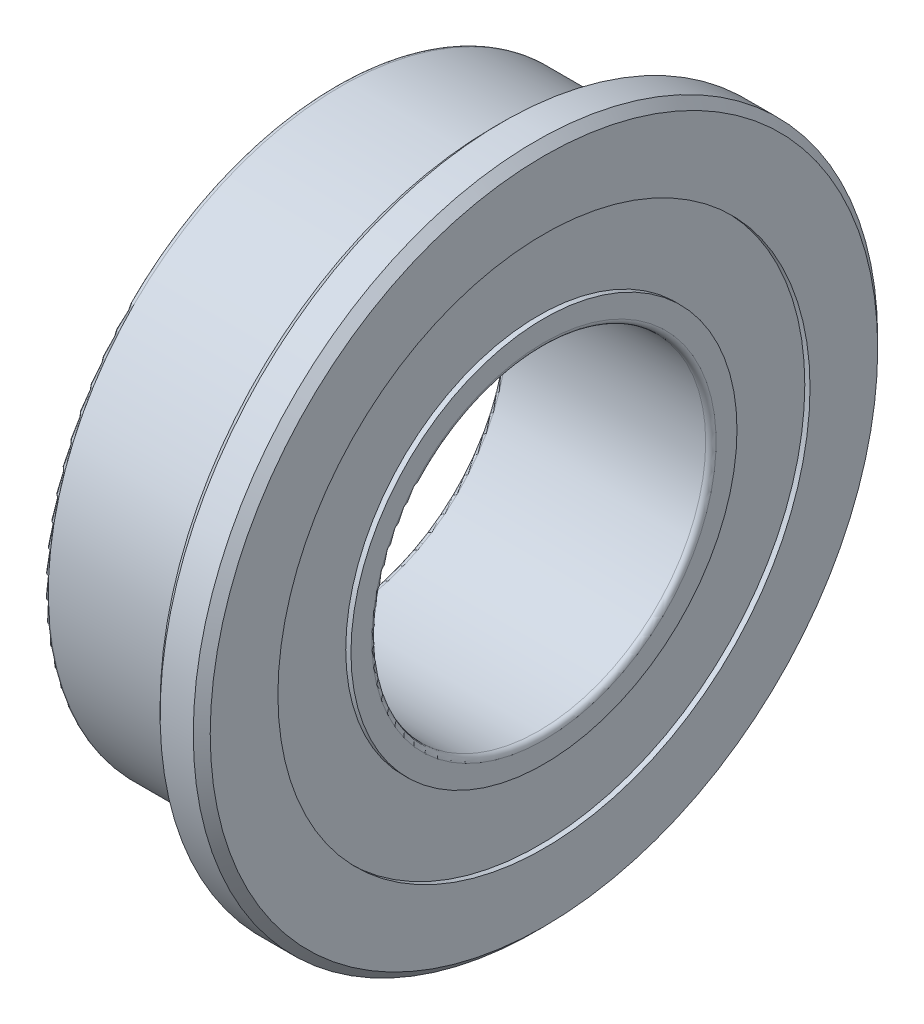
ISO-10303-21;
HEADER;
FILE_DESCRIPTION(('STEP AP214'),'2;1');
FILE_NAME('part.step','',(''),(''),'','','');
FILE_SCHEMA(('AUTOMOTIVE_DESIGN { 1 0 10303 214 1 1 1 1 }'));
ENDSEC;
DATA;
#1=APPLICATION_CONTEXT('core data for automotive mechanical design processes');
#2=APPLICATION_PROTOCOL_DEFINITION('international standard','automotive_design',2000,#1);
#3=PRODUCT_CONTEXT('',#1,'mechanical');
#4=PRODUCT('Part','Part','',(#3));
#5=PRODUCT_RELATED_PRODUCT_CATEGORY('part','',(#4));
#6=PRODUCT_DEFINITION_FORMATION('','',#4);
#7=PRODUCT_DEFINITION_CONTEXT('part definition',#1,'design');
#8=PRODUCT_DEFINITION('design','',#6,#7);
#9=PRODUCT_DEFINITION_SHAPE('','',#8);
#10=(LENGTH_UNIT() NAMED_UNIT(*) SI_UNIT(.MILLI.,.METRE.));
#11=(NAMED_UNIT(*) PLANE_ANGLE_UNIT() SI_UNIT($,.RADIAN.));
#12=(NAMED_UNIT(*) SI_UNIT($,.STERADIAN.) SOLID_ANGLE_UNIT());
#13=UNCERTAINTY_MEASURE_WITH_UNIT(LENGTH_MEASURE(1.E-05),#10,'distance_accuracy_value','');
#14=(GEOMETRIC_REPRESENTATION_CONTEXT(3) GLOBAL_UNCERTAINTY_ASSIGNED_CONTEXT((#13)) GLOBAL_UNIT_ASSIGNED_CONTEXT((#10,
#11,#12)) REPRESENTATION_CONTEXT('',''));
#15=CARTESIAN_POINT('',(0.,0.,0.));
#16=DIRECTION('',(0.,0.,1.));
#17=DIRECTION('',(1.,0.,0.));
#18=AXIS2_PLACEMENT_3D('',#15,#16,#17);
#19=CARTESIAN_POINT('',(0.,-2.75,0.));
#20=DIRECTION('',(0.,1.,0.));
#21=DIRECTION('',(0.,0.,1.));
#22=AXIS2_PLACEMENT_3D('',#19,#20,#21);
#23=SPHERICAL_SURFACE('',#22,0.625);
#24=CARTESIAN_POINT('',(0.,-2.125,0.));
#25=VERTEX_POINT('',#24);
#26=VERTEX_LOOP('',#25);
#27=FACE_BOUND('',#26,.T.);
#28=CARTESIAN_POINT('',(0.,-3.375,0.));
#29=VERTEX_POINT('',#28);
#30=VERTEX_LOOP('',#29);
#31=FACE_BOUND('',#30,.T.);
#32=ADVANCED_FACE('P0_F16',(#27,#31),#23,.T.);
#33=CLOSED_SHELL('',(#32));
#34=MANIFOLD_SOLID_BREP('P0_B1',#33);
#35=CARTESIAN_POINT('',(0.,2.224796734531,1.616409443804));
#36=DIRECTION('',(0.,-0.809016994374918,-0.587785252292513));
#37=DIRECTION('',(0.,0.587785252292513,-0.809016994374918));
#38=AXIS2_PLACEMENT_3D('',#35,#36,#37);
#39=SPHERICAL_SURFACE('',#38,0.625);
#40=CARTESIAN_POINT('',(0.,1.71916111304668,1.24904366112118));
#41=VERTEX_POINT('',#40);
#42=VERTEX_LOOP('',#41);
#43=FACE_BOUND('',#42,.T.);
#44=CARTESIAN_POINT('',(0.,2.73043235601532,1.98377522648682));
#45=VERTEX_POINT('',#44);
#46=VERTEX_LOOP('',#45);
#47=FACE_BOUND('',#46,.T.);
#48=ADVANCED_FACE('P1_F16',(#43,#47),#39,.T.);
#49=CLOSED_SHELL('',(#48));
#50=MANIFOLD_SOLID_BREP('P1_B1',#49);
#51=CARTESIAN_POINT('',(1.25,0.,0.));
#52=DIRECTION('',(1.,0.,0.));
#53=DIRECTION('',(0.,0.,-1.));
#54=AXIS2_PLACEMENT_3D('',#51,#52,#53);
#55=PLANE('',#54);
#56=CARTESIAN_POINT('',(1.25,0.,0.));
#57=DIRECTION('',(1.,0.,0.));
#58=DIRECTION('',(0.,1.,0.));
#59=AXIS2_PLACEMENT_3D('',#56,#57,#58);
#60=CIRCLE('',#59,2.0625);
#61=CARTESIAN_POINT('',(1.25,2.0625,0.));
#62=VERTEX_POINT('',#61);
#63=CARTESIAN_POINT('',(1.25,-2.0625,0.));
#64=VERTEX_POINT('',#63);
#65=EDGE_CURVE('P2_E58',#62,#64,#60,.T.);
#66=ORIENTED_EDGE('',*,*,#65,.F.);
#67=CARTESIAN_POINT('',(1.25,0.,0.));
#68=DIRECTION('',(1.,0.,0.));
#69=DIRECTION('',(0.,-1.,0.));
#70=AXIS2_PLACEMENT_3D('',#67,#68,#69);
#71=CIRCLE('',#70,2.0625);
#72=EDGE_CURVE('P2_E63',#64,#62,#71,.T.);
#73=ORIENTED_EDGE('',*,*,#72,.F.);
#74=EDGE_LOOP('',(#66,#73));
#75=FACE_BOUND('',#74,.T.);
#76=CARTESIAN_POINT('',(1.25,0.,0.));
#77=DIRECTION('',(1.,0.,0.));
#78=DIRECTION('',(0.,0.,-1.));
#79=AXIS2_PLACEMENT_3D('',#76,#77,#78);
#80=CIRCLE('',#79,2.3125);
#81=CARTESIAN_POINT('',(1.25,0.,-2.3125));
#82=VERTEX_POINT('',#81);
#83=EDGE_CURVE('P2_E71',#82,#82,#80,.F.);
#84=ORIENTED_EDGE('',*,*,#83,.F.);
#85=EDGE_LOOP('',(#84));
#86=FACE_BOUND('',#85,.T.);
#87=ADVANCED_FACE('P2_F18',(#75,#86),#55,.T.);
#88=CARTESIAN_POINT('',(1.1875,0.,0.));
#89=DIRECTION('',(1.,0.,0.));
#90=DIRECTION('',(0.,-1.,0.));
#91=AXIS2_PLACEMENT_3D('',#88,#89,#90);
#92=TOROIDAL_SURFACE('',#91,2.0625,0.0625);
#93=ORIENTED_EDGE('',*,*,#65,.T.);
#94=ORIENTED_EDGE('',*,*,#72,.T.);
#95=EDGE_LOOP('',(#93,#94));
#96=FACE_BOUND('',#95,.T.);
#97=CARTESIAN_POINT('',(1.1875,0.,0.));
#98=DIRECTION('',(1.,0.,0.));
#99=DIRECTION('',(0.,0.,-1.));
#100=AXIS2_PLACEMENT_3D('',#97,#98,#99);
#101=CIRCLE('',#100,2.);
#102=CARTESIAN_POINT('',(1.1875,0.,-2.));
#103=VERTEX_POINT('',#102);
#104=EDGE_CURVE('P2_E94',#103,#103,#101,.F.);
#105=ORIENTED_EDGE('',*,*,#104,.T.);
#106=EDGE_LOOP('',(#105));
#107=FACE_BOUND('',#106,.T.);
#108=ADVANCED_FACE('P2_F69',(#96,#107),#92,.T.);
#109=CARTESIAN_POINT('',(-1.375,0.,0.));
#110=DIRECTION('',(1.,0.,0.));
#111=DIRECTION('',(0.,0.,-1.));
#112=AXIS2_PLACEMENT_3D('',#109,#110,#111);
#113=CYLINDRICAL_SURFACE('',#112,2.3125);
#114=ORIENTED_EDGE('',*,*,#83,.T.);
#115=EDGE_LOOP('',(#114));
#116=FACE_BOUND('',#115,.T.);
#117=CARTESIAN_POINT('',(1.1875,0.,0.));
#118=DIRECTION('',(1.,0.,0.));
#119=DIRECTION('',(0.,0.,-1.));
#120=AXIS2_PLACEMENT_3D('',#117,#118,#119);
#121=CIRCLE('',#120,2.3125);
#122=CARTESIAN_POINT('',(1.1875,0.,-2.3125));
#123=VERTEX_POINT('',#122);
#124=EDGE_CURVE('P2_E97',#123,#123,#121,.F.);
#125=ORIENTED_EDGE('',*,*,#124,.F.);
#126=EDGE_LOOP('',(#125));
#127=FACE_BOUND('',#126,.T.);
#128=ADVANCED_FACE('P2_F89',(#116,#127),#113,.T.);
#129=CARTESIAN_POINT('',(-1.375,0.,0.));
#130=DIRECTION('',(1.,0.,0.));
#131=DIRECTION('',(0.,0.,-1.));
#132=AXIS2_PLACEMENT_3D('',#129,#130,#131);
#133=CYLINDRICAL_SURFACE('',#132,2.);
#134=ORIENTED_EDGE('',*,*,#104,.F.);
#135=EDGE_LOOP('',(#134));
#136=FACE_BOUND('',#135,.T.);
#137=CARTESIAN_POINT('',(-1.1875,0.,0.));
#138=DIRECTION('',(1.,0.,0.));
#139=DIRECTION('',(0.,-1.,0.));
#140=AXIS2_PLACEMENT_3D('',#137,#138,#139);
#141=CIRCLE('',#140,2.);
#142=CARTESIAN_POINT('',(-1.1875,-2.,0.));
#143=VERTEX_POINT('',#142);
#144=EDGE_CURVE('P2_E98',#143,#143,#141,.T.);
#145=ORIENTED_EDGE('',*,*,#144,.F.);
#146=EDGE_LOOP('',(#145));
#147=FACE_BOUND('',#146,.T.);
#148=ADVANCED_FACE('P2_F561',(#136,#147),#133,.F.);
#149=CARTESIAN_POINT('',(1.1875,0.,0.));
#150=DIRECTION('',(1.,0.,0.));
#151=DIRECTION('',(0.,0.,-1.));
#152=AXIS2_PLACEMENT_3D('',#149,#150,#151);
#153=PLANE('',#152);
#154=ORIENTED_EDGE('',*,*,#124,.T.);
#155=EDGE_LOOP('',(#154));
#156=FACE_BOUND('',#155,.T.);
#157=CARTESIAN_POINT('',(1.1875,0.,0.));
#158=DIRECTION('',(1.,0.,0.));
#159=DIRECTION('',(0.,0.,-1.));
#160=AXIS2_PLACEMENT_3D('',#157,#158,#159);
#161=CIRCLE('',#160,3.1875);
#162=CARTESIAN_POINT('',(1.1875,0.,-3.1875));
#163=VERTEX_POINT('',#162);
#164=EDGE_CURVE('P2_E101',#163,#163,#161,.T.);
#165=ORIENTED_EDGE('',*,*,#164,.T.);
#166=EDGE_LOOP('',(#165));
#167=FACE_BOUND('',#166,.T.);
#168=ADVANCED_FACE('P2_F118',(#156,#167),#153,.T.);
#169=CARTESIAN_POINT('',(-1.1875,0.,0.));
#170=DIRECTION('',(1.,0.,0.));
#171=DIRECTION('',(0.,-1.,0.));
#172=AXIS2_PLACEMENT_3D('',#169,#170,#171);
#173=TOROIDAL_SURFACE('',#172,2.0625,0.0625);
#174=ORIENTED_EDGE('',*,*,#144,.T.);
#175=EDGE_LOOP('',(#174));
#176=FACE_BOUND('',#175,.T.);
#177=CARTESIAN_POINT('',(-1.25,0.,0.));
#178=DIRECTION('',(-1.,0.,0.));
#179=DIRECTION('',(0.,1.,0.));
#180=AXIS2_PLACEMENT_3D('',#177,#178,#179);
#181=CIRCLE('',#180,2.0625);
#182=CARTESIAN_POINT('',(-1.25,2.0625,0.));
#183=VERTEX_POINT('',#182);
#184=CARTESIAN_POINT('',(-1.25,-2.0625,0.));
#185=VERTEX_POINT('',#184);
#186=EDGE_CURVE('P2_E337',#183,#185,#181,.T.);
#187=ORIENTED_EDGE('',*,*,#186,.T.);
#188=CARTESIAN_POINT('',(-1.25,0.,0.));
#189=DIRECTION('',(-1.,0.,0.));
#190=DIRECTION('',(0.,-1.,0.));
#191=AXIS2_PLACEMENT_3D('',#188,#189,#190);
#192=CIRCLE('',#191,2.0625);
#193=EDGE_CURVE('P2_E152',#185,#183,#192,.T.);
#194=ORIENTED_EDGE('',*,*,#193,.T.);
#195=EDGE_LOOP('',(#187,#194));
#196=FACE_BOUND('',#195,.T.);
#197=ADVANCED_FACE('P2_F107',(#176,#196),#173,.T.);
#198=CARTESIAN_POINT('',(-1.375,0.,0.));
#199=DIRECTION('',(1.,0.,0.));
#200=DIRECTION('',(0.,0.,-1.));
#201=AXIS2_PLACEMENT_3D('',#198,#199,#200);
#202=CYLINDRICAL_SURFACE('',#201,3.1875);
#203=CARTESIAN_POINT('',(1.25,0.,0.));
#204=DIRECTION('',(1.,0.,0.));
#205=DIRECTION('',(0.,0.,-1.));
#206=AXIS2_PLACEMENT_3D('',#203,#204,#205);
#207=CIRCLE('',#206,3.1875);
#208=CARTESIAN_POINT('',(1.25,0.,-3.1875));
#209=VERTEX_POINT('',#208);
#210=EDGE_CURVE('P2_E334',#209,#209,#207,.F.);
#211=ORIENTED_EDGE('',*,*,#210,.F.);
#212=EDGE_LOOP('',(#211));
#213=FACE_BOUND('',#212,.T.);
#214=ORIENTED_EDGE('',*,*,#164,.F.);
#215=EDGE_LOOP('',(#214));
#216=FACE_BOUND('',#215,.T.);
#217=ADVANCED_FACE('P2_F117',(#213,#216),#202,.F.);
#218=CARTESIAN_POINT('',(-1.25,0.,0.));
#219=DIRECTION('',(1.,0.,0.));
#220=DIRECTION('',(0.,0.,-1.));
#221=AXIS2_PLACEMENT_3D('',#218,#219,#220);
#222=PLANE('',#221);
#223=ORIENTED_EDGE('',*,*,#193,.F.);
#224=ORIENTED_EDGE('',*,*,#186,.F.);
#225=EDGE_LOOP('',(#223,#224));
#226=FACE_BOUND('',#225,.T.);
#227=CARTESIAN_POINT('',(-1.25,0.,0.));
#228=DIRECTION('',(1.,0.,0.));
#229=DIRECTION('',(0.,0.,-1.));
#230=AXIS2_PLACEMENT_3D('',#227,#228,#229);
#231=CIRCLE('',#230,2.3125);
#232=CARTESIAN_POINT('',(-1.25,0.,-2.3125));
#233=VERTEX_POINT('',#232);
#234=EDGE_CURVE('P2_E332',#233,#233,#231,.T.);
#235=ORIENTED_EDGE('',*,*,#234,.F.);
#236=EDGE_LOOP('',(#235));
#237=FACE_BOUND('',#236,.T.);
#238=ADVANCED_FACE('P2_F129',(#226,#237),#222,.F.);
#239=CARTESIAN_POINT('',(1.25,0.,0.));
#240=DIRECTION('',(1.,0.,0.));
#241=DIRECTION('',(0.,0.,-1.));
#242=AXIS2_PLACEMENT_3D('',#239,#240,#241);
#243=PLANE('',#242);
#244=ORIENTED_EDGE('',*,*,#210,.T.);
#245=EDGE_LOOP('',(#244));
#246=FACE_BOUND('',#245,.T.);
#247=CARTESIAN_POINT('',(1.25000000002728,0.,0.));
#248=DIRECTION('',(-1.,0.,0.));
#249=DIRECTION('',(0.,0.,1.));
#250=AXIS2_PLACEMENT_3D('',#247,#248,#249);
#251=CIRCLE('',#250,3.9984000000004);
#252=CARTESIAN_POINT('',(1.25000000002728,0.,3.9984000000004));
#253=VERTEX_POINT('',#252);
#254=EDGE_CURVE('P2_E329',#253,#253,#251,.T.);
#255=ORIENTED_EDGE('',*,*,#254,.F.);
#256=EDGE_LOOP('',(#255));
#257=FACE_BOUND('',#256,.T.);
#258=ADVANCED_FACE('P2_F138',(#246,#257),#243,.T.);
#259=CARTESIAN_POINT('',(-1.375,0.,0.));
#260=DIRECTION('',(1.,0.,0.));
#261=DIRECTION('',(0.,0.,-1.));
#262=AXIS2_PLACEMENT_3D('',#259,#260,#261);
#263=CYLINDRICAL_SURFACE('',#262,2.3125);
#264=ORIENTED_EDGE('',*,*,#234,.T.);
#265=EDGE_LOOP('',(#264));
#266=FACE_BOUND('',#265,.T.);
#267=CARTESIAN_POINT('',(-1.1875,0.,0.));
#268=DIRECTION('',(1.,0.,0.));
#269=DIRECTION('',(0.,0.,-1.));
#270=AXIS2_PLACEMENT_3D('',#267,#268,#269);
#271=CIRCLE('',#270,2.3125);
#272=CARTESIAN_POINT('',(-1.1875,0.,-2.3125));
#273=VERTEX_POINT('',#272);
#274=EDGE_CURVE('P2_E157',#273,#273,#271,.F.);
#275=ORIENTED_EDGE('',*,*,#274,.T.);
#276=EDGE_LOOP('',(#275));
#277=FACE_BOUND('',#276,.T.);
#278=ADVANCED_FACE('P2_F264',(#266,#277),#263,.T.);
#279=CARTESIAN_POINT('',(1.14840000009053,0.,0.));
#280=DIRECTION('',(-1.,0.,0.));
#281=DIRECTION('',(0.,0.,1.));
#282=AXIS2_PLACEMENT_3D('',#279,#280,#281);
#283=CONICAL_SURFACE('',#282,4.09999999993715,0.785398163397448);
#284=ORIENTED_EDGE('',*,*,#254,.T.);
#285=EDGE_LOOP('',(#284));
#286=FACE_BOUND('',#285,.T.);
#287=CARTESIAN_POINT('',(1.1484,0.,0.));
#288=DIRECTION('',(1.,0.,0.));
#289=DIRECTION('',(0.,0.,-1.));
#290=AXIS2_PLACEMENT_3D('',#287,#288,#289);
#291=CIRCLE('',#290,4.1);
#292=CARTESIAN_POINT('',(1.1484,0.,-4.1));
#293=VERTEX_POINT('',#292);
#294=EDGE_CURVE('P2_E153',#293,#293,#291,.F.);
#295=ORIENTED_EDGE('',*,*,#294,.F.);
#296=EDGE_LOOP('',(#295));
#297=FACE_BOUND('',#296,.T.);
#298=ADVANCED_FACE('P2_F261',(#286,#297),#283,.T.);
#299=CARTESIAN_POINT('',(-1.1875,0.,0.));
#300=DIRECTION('',(1.,0.,0.));
#301=DIRECTION('',(0.,0.,-1.));
#302=AXIS2_PLACEMENT_3D('',#299,#300,#301);
#303=PLANE('',#302);
#304=ORIENTED_EDGE('',*,*,#274,.F.);
#305=EDGE_LOOP('',(#304));
#306=FACE_BOUND('',#305,.T.);
#307=CARTESIAN_POINT('',(-1.1875,0.,0.));
#308=DIRECTION('',(1.,0.,0.));
#309=DIRECTION('',(0.,0.,-1.));
#310=AXIS2_PLACEMENT_3D('',#307,#308,#309);
#311=CIRCLE('',#310,3.1875);
#312=CARTESIAN_POINT('',(-1.1875,0.,-3.1875));
#313=VERTEX_POINT('',#312);
#314=EDGE_CURVE('P2_E156',#313,#313,#311,.F.);
#315=ORIENTED_EDGE('',*,*,#314,.T.);
#316=EDGE_LOOP('',(#315));
#317=FACE_BOUND('',#316,.T.);
#318=ADVANCED_FACE('P2_F257',(#306,#317),#303,.F.);
#319=CARTESIAN_POINT('',(0.515,0.,0.));
#320=DIRECTION('',(1.,0.,0.));
#321=DIRECTION('',(0.,0.,-1.));
#322=AXIS2_PLACEMENT_3D('',#319,#320,#321);
#323=CYLINDRICAL_SURFACE('',#322,4.1);
#324=ORIENTED_EDGE('',*,*,#294,.T.);
#325=EDGE_LOOP('',(#324));
#326=FACE_BOUND('',#325,.T.);
#327=CARTESIAN_POINT('',(0.75159999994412,0.,0.));
#328=DIRECTION('',(1.,0.,0.));
#329=DIRECTION('',(0.,-1.,0.));
#330=AXIS2_PLACEMENT_3D('',#327,#328,#329);
#331=CIRCLE('',#330,4.099999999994);
#332=CARTESIAN_POINT('',(0.751599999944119,-4.099999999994,0.));
#333=VERTEX_POINT('',#332);
#334=EDGE_CURVE('P2_E158',#333,#333,#331,.F.);
#335=ORIENTED_EDGE('',*,*,#334,.F.);
#336=EDGE_LOOP('',(#335));
#337=FACE_BOUND('',#336,.T.);
#338=ADVANCED_FACE('P2_F253',(#326,#337),#323,.T.);
#339=CARTESIAN_POINT('',(-1.375,0.,0.));
#340=DIRECTION('',(1.,0.,0.));
#341=DIRECTION('',(0.,0.,-1.));
#342=AXIS2_PLACEMENT_3D('',#339,#340,#341);
#343=CYLINDRICAL_SURFACE('',#342,3.1875);
#344=CARTESIAN_POINT('',(-1.25,0.,0.));
#345=DIRECTION('',(1.,0.,0.));
#346=DIRECTION('',(0.,0.,-1.));
#347=AXIS2_PLACEMENT_3D('',#344,#345,#346);
#348=CIRCLE('',#347,3.1875);
#349=CARTESIAN_POINT('',(-1.25,0.,-3.1875));
#350=VERTEX_POINT('',#349);
#351=EDGE_CURVE('P2_E160',#350,#350,#348,.F.);
#352=ORIENTED_EDGE('',*,*,#351,.T.);
#353=EDGE_LOOP('',(#352));
#354=FACE_BOUND('',#353,.T.);
#355=ORIENTED_EDGE('',*,*,#314,.F.);
#356=EDGE_LOOP('',(#355));
#357=FACE_BOUND('',#356,.T.);
#358=ADVANCED_FACE('P2_F249',(#354,#357),#343,.F.);
#359=CARTESIAN_POINT('',(0.751599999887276,0.,0.));
#360=DIRECTION('',(1.,0.,0.));
#361=DIRECTION('',(0.,0.,-1.));
#362=AXIS2_PLACEMENT_3D('',#359,#360,#361);
#363=CONICAL_SURFACE('',#362,4.09999999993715,0.785398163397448);
#364=ORIENTED_EDGE('',*,*,#334,.T.);
#365=EDGE_LOOP('',(#364));
#366=FACE_BOUND('',#365,.T.);
#367=CARTESIAN_POINT('',(0.649999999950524,0.,0.));
#368=DIRECTION('',(1.,0.,0.));
#369=DIRECTION('',(0.,0.,-1.));
#370=AXIS2_PLACEMENT_3D('',#367,#368,#369);
#371=CIRCLE('',#370,3.9984000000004);
#372=CARTESIAN_POINT('',(0.649999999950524,0.,-3.9984000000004));
#373=VERTEX_POINT('',#372);
#374=EDGE_CURVE('P2_E79',#373,#373,#371,.T.);
#375=ORIENTED_EDGE('',*,*,#374,.T.);
#376=EDGE_LOOP('',(#375));
#377=FACE_BOUND('',#376,.T.);
#378=ADVANCED_FACE('P2_F237',(#366,#377),#363,.T.);
#379=CARTESIAN_POINT('',(-1.25,0.,0.));
#380=DIRECTION('',(1.,0.,0.));
#381=DIRECTION('',(0.,0.,-1.));
#382=AXIS2_PLACEMENT_3D('',#379,#380,#381);
#383=PLANE('',#382);
#384=ORIENTED_EDGE('',*,*,#351,.F.);
#385=EDGE_LOOP('',(#384));
#386=FACE_BOUND('',#385,.T.);
#387=CARTESIAN_POINT('',(-1.25,0.,0.));
#388=DIRECTION('',(1.,0.,0.));
#389=DIRECTION('',(0.,-1.,0.));
#390=AXIS2_PLACEMENT_3D('',#387,#388,#389);
#391=CIRCLE('',#390,3.4375);
#392=CARTESIAN_POINT('',(-1.25,-3.4375,0.));
#393=VERTEX_POINT('',#392);
#394=CARTESIAN_POINT('',(-1.25,3.4375,0.));
#395=VERTEX_POINT('',#394);
#396=EDGE_CURVE('P2_E224',#393,#395,#391,.T.);
#397=ORIENTED_EDGE('',*,*,#396,.F.);
#398=CARTESIAN_POINT('',(-1.25,0.,0.));
#399=DIRECTION('',(1.,0.,0.));
#400=DIRECTION('',(0.,1.,0.));
#401=AXIS2_PLACEMENT_3D('',#398,#399,#400);
#402=CIRCLE('',#401,3.4375);
#403=EDGE_CURVE('P2_E316',#395,#393,#402,.T.);
#404=ORIENTED_EDGE('',*,*,#403,.F.);
#405=EDGE_LOOP('',(#397,#404));
#406=FACE_BOUND('',#405,.T.);
#407=ADVANCED_FACE('P2_F228',(#386,#406),#383,.F.);
#408=CARTESIAN_POINT('',(0.65,0.,0.));
#409=DIRECTION('',(1.,0.,0.));
#410=DIRECTION('',(0.,0.,-1.));
#411=AXIS2_PLACEMENT_3D('',#408,#409,#410);
#412=PLANE('',#411);
#413=CARTESIAN_POINT('',(0.65,0.,0.));
#414=DIRECTION('',(-1.,0.,0.));
#415=DIRECTION('',(0.,-1.,0.));
#416=AXIS2_PLACEMENT_3D('',#413,#414,#415);
#417=CIRCLE('',#416,3.6);
#418=CARTESIAN_POINT('',(0.65,3.6,0.));
#419=VERTEX_POINT('',#418);
#420=CARTESIAN_POINT('',(0.65,-3.6,0.));
#421=VERTEX_POINT('',#420);
#422=EDGE_CURVE('P2_E194',#419,#421,#417,.F.);
#423=ORIENTED_EDGE('',*,*,#422,.T.);
#424=CARTESIAN_POINT('',(0.65,0.,0.));
#425=DIRECTION('',(-1.,0.,0.));
#426=DIRECTION('',(0.,1.,0.));
#427=AXIS2_PLACEMENT_3D('',#424,#425,#426);
#428=CIRCLE('',#427,3.6);
#429=EDGE_CURVE('P2_E37',#419,#421,#428,.T.);
#430=ORIENTED_EDGE('',*,*,#429,.F.);
#431=EDGE_LOOP('',(#423,#430));
#432=FACE_BOUND('',#431,.T.);
#433=ORIENTED_EDGE('',*,*,#374,.F.);
#434=EDGE_LOOP('',(#433));
#435=FACE_BOUND('',#434,.T.);
#436=ADVANCED_FACE('P2_F180',(#432,#435),#412,.F.);
#437=CARTESIAN_POINT('',(-1.1875,0.,0.));
#438=DIRECTION('',(1.,0.,0.));
#439=DIRECTION('',(0.,-1.,0.));
#440=AXIS2_PLACEMENT_3D('',#437,#438,#439);
#441=TOROIDAL_SURFACE('',#440,3.4375,0.0625);
#442=CARTESIAN_POINT('',(-1.1875,0.,0.));
#443=DIRECTION('',(1.,0.,0.));
#444=DIRECTION('',(0.,0.,-1.));
#445=AXIS2_PLACEMENT_3D('',#442,#443,#444);
#446=CIRCLE('',#445,3.5);
#447=CARTESIAN_POINT('',(-1.1875,0.,-3.5));
#448=VERTEX_POINT('',#447);
#449=EDGE_CURVE('P2_E29',#448,#448,#446,.T.);
#450=ORIENTED_EDGE('',*,*,#449,.F.);
#451=EDGE_LOOP('',(#450));
#452=FACE_BOUND('',#451,.T.);
#453=ORIENTED_EDGE('',*,*,#403,.T.);
#454=ORIENTED_EDGE('',*,*,#396,.T.);
#455=EDGE_LOOP('',(#453,#454));
#456=FACE_BOUND('',#455,.T.);
#457=ADVANCED_FACE('P2_F168',(#452,#456),#441,.T.);
#458=CARTESIAN_POINT('',(0.55,0.,0.));
#459=DIRECTION('',(1.,0.,0.));
#460=DIRECTION('',(0.,-1.,0.));
#461=AXIS2_PLACEMENT_3D('',#458,#459,#460);
#462=TOROIDAL_SURFACE('',#461,3.6,0.1);
#463=ORIENTED_EDGE('',*,*,#429,.T.);
#464=ORIENTED_EDGE('',*,*,#422,.F.);
#465=EDGE_LOOP('',(#463,#464));
#466=FACE_BOUND('',#465,.T.);
#467=CARTESIAN_POINT('',(0.55,0.,0.));
#468=DIRECTION('',(1.,0.,0.));
#469=DIRECTION('',(0.,0.,-1.));
#470=AXIS2_PLACEMENT_3D('',#467,#468,#469);
#471=CIRCLE('',#470,3.5);
#472=CARTESIAN_POINT('',(0.55,0.,-3.5));
#473=VERTEX_POINT('',#472);
#474=EDGE_CURVE('P2_E11',#473,#473,#471,.F.);
#475=ORIENTED_EDGE('',*,*,#474,.F.);
#476=EDGE_LOOP('',(#475));
#477=FACE_BOUND('',#476,.T.);
#478=ADVANCED_FACE('P2_F179',(#466,#477),#462,.F.);
#479=CARTESIAN_POINT('',(-1.375,0.,0.));
#480=DIRECTION('',(1.,0.,0.));
#481=DIRECTION('',(0.,0.,-1.));
#482=AXIS2_PLACEMENT_3D('',#479,#480,#481);
#483=CYLINDRICAL_SURFACE('',#482,3.5);
#484=ORIENTED_EDGE('',*,*,#449,.T.);
#485=EDGE_LOOP('',(#484));
#486=FACE_BOUND('',#485,.T.);
#487=ORIENTED_EDGE('',*,*,#474,.T.);
#488=EDGE_LOOP('',(#487));
#489=FACE_BOUND('',#488,.T.);
#490=ADVANCED_FACE('P2_F275',(#486,#489),#483,.T.);
#491=CLOSED_SHELL('',(#87,#108,#128,#148,#168,#197,#217,#238,#258,#278,#298,#318,#338,#358,#378,
#407,#436,#457,#478,#490));
#492=CARTESIAN_POINT('',(-0.9335,0.,0.));
#493=DIRECTION('',(1.,0.,0.));
#494=DIRECTION('',(0.,0.,-1.));
#495=AXIS2_PLACEMENT_3D('',#492,#493,#494);
#496=PLANE('',#495);
#497=CARTESIAN_POINT('',(-0.9335,0.,0.));
#498=DIRECTION('',(1.,0.,0.));
#499=DIRECTION('',(0.,0.,-1.));
#500=AXIS2_PLACEMENT_3D('',#497,#498,#499);
#501=CIRCLE('',#500,2.3125);
#502=CARTESIAN_POINT('',(-0.9335,0.,-2.3125));
#503=VERTEX_POINT('',#502);
#504=EDGE_CURVE('P2_E314',#503,#503,#501,.T.);
#505=ORIENTED_EDGE('',*,*,#504,.F.);
#506=EDGE_LOOP('',(#505));
#507=FACE_BOUND('',#506,.T.);
#508=CARTESIAN_POINT('',(-0.9335,0.,0.));
#509=DIRECTION('',(1.,0.,0.));
#510=DIRECTION('',(0.,0.,-1.));
#511=AXIS2_PLACEMENT_3D('',#508,#509,#510);
#512=CIRCLE('',#511,3.1875);
#513=CARTESIAN_POINT('',(-0.9335,0.,-3.1875));
#514=VERTEX_POINT('',#513);
#515=EDGE_CURVE('P2_E352',#514,#514,#512,.T.);
#516=ORIENTED_EDGE('',*,*,#515,.T.);
#517=EDGE_LOOP('',(#516));
#518=FACE_BOUND('',#517,.T.);
#519=ADVANCED_FACE('P2_F285',(#507,#518),#496,.T.);
#520=CARTESIAN_POINT('',(-1.375,0.,0.));
#521=DIRECTION('',(1.,0.,0.));
#522=DIRECTION('',(0.,0.,-1.));
#523=AXIS2_PLACEMENT_3D('',#520,#521,#522);
#524=CYLINDRICAL_SURFACE('',#523,3.1875);
#525=CARTESIAN_POINT('',(-0.446339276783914,0.,0.));
#526=DIRECTION('',(1.,0.,0.));
#527=DIRECTION('',(0.,-1.,0.));
#528=AXIS2_PLACEMENT_3D('',#525,#526,#527);
#529=CIRCLE('',#528,3.18750000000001);
#530=CARTESIAN_POINT('',(-0.446339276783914,-3.18750000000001,0.));
#531=VERTEX_POINT('',#530);
#532=EDGE_CURVE('P2_E312',#531,#531,#529,.T.);
#533=ORIENTED_EDGE('',*,*,#532,.T.);
#534=EDGE_LOOP('',(#533));
#535=FACE_BOUND('',#534,.T.);
#536=ORIENTED_EDGE('',*,*,#515,.F.);
#537=EDGE_LOOP('',(#536));
#538=FACE_BOUND('',#537,.T.);
#539=ADVANCED_FACE('P2_F287',(#535,#538),#524,.F.);
#540=CARTESIAN_POINT('',(-1.375,0.,0.));
#541=DIRECTION('',(1.,0.,0.));
#542=DIRECTION('',(0.,0.,-1.));
#543=AXIS2_PLACEMENT_3D('',#540,#541,#542);
#544=CYLINDRICAL_SURFACE('',#543,2.3125);
#545=CARTESIAN_POINT('',(-0.446339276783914,0.,0.));
#546=DIRECTION('',(1.,0.,0.));
#547=DIRECTION('',(0.,-1.,0.));
#548=AXIS2_PLACEMENT_3D('',#545,#546,#547);
#549=CIRCLE('',#548,2.31249999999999);
#550=CARTESIAN_POINT('',(-0.446339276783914,-2.31249999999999,0.));
#551=VERTEX_POINT('',#550);
#552=EDGE_CURVE('P2_E309',#551,#551,#549,.F.);
#553=ORIENTED_EDGE('',*,*,#552,.T.);
#554=EDGE_LOOP('',(#553));
#555=FACE_BOUND('',#554,.T.);
#556=ORIENTED_EDGE('',*,*,#504,.T.);
#557=EDGE_LOOP('',(#556));
#558=FACE_BOUND('',#557,.T.);
#559=ADVANCED_FACE('P2_F292',(#555,#558),#544,.T.);
#560=CARTESIAN_POINT('',(0.,0.,0.));
#561=DIRECTION('',(1.,0.,0.));
#562=DIRECTION('',(0.,-1.,0.));
#563=AXIS2_PLACEMENT_3D('',#560,#561,#562);
#564=TOROIDAL_SURFACE('',#563,2.75,0.625);
#565=CARTESIAN_POINT('',(0.4463392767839,0.,0.));
#566=DIRECTION('',(1.,0.,0.));
#567=DIRECTION('',(0.,0.,-1.));
#568=AXIS2_PLACEMENT_3D('',#565,#566,#567);
#569=CIRCLE('',#568,3.1875);
#570=CARTESIAN_POINT('',(0.4463392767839,0.,-3.1875));
#571=VERTEX_POINT('',#570);
#572=EDGE_CURVE('P2_E308',#571,#571,#569,.T.);
#573=ORIENTED_EDGE('',*,*,#572,.T.);
#574=EDGE_LOOP('',(#573));
#575=FACE_BOUND('',#574,.T.);
#576=ORIENTED_EDGE('',*,*,#532,.F.);
#577=EDGE_LOOP('',(#576));
#578=FACE_BOUND('',#577,.T.);
#579=ADVANCED_FACE('P2_F296',(#575,#578),#564,.F.);
#580=CARTESIAN_POINT('',(0.,0.,0.));
#581=DIRECTION('',(1.,0.,0.));
#582=DIRECTION('',(0.,-1.,0.));
#583=AXIS2_PLACEMENT_3D('',#580,#581,#582);
#584=TOROIDAL_SURFACE('',#583,2.75,0.625);
#585=ORIENTED_EDGE('',*,*,#552,.F.);
#586=EDGE_LOOP('',(#585));
#587=FACE_BOUND('',#586,.T.);
#588=CARTESIAN_POINT('',(0.4463392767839,0.,0.));
#589=DIRECTION('',(1.,0.,0.));
#590=DIRECTION('',(0.,0.,-1.));
#591=AXIS2_PLACEMENT_3D('',#588,#589,#590);
#592=CIRCLE('',#591,2.3125);
#593=CARTESIAN_POINT('',(0.4463392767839,0.,-2.3125));
#594=VERTEX_POINT('',#593);
#595=EDGE_CURVE('P2_E349',#594,#594,#592,.T.);
#596=ORIENTED_EDGE('',*,*,#595,.F.);
#597=EDGE_LOOP('',(#596));
#598=FACE_BOUND('',#597,.T.);
#599=ADVANCED_FACE('P2_F301',(#587,#598),#584,.F.);
#600=CARTESIAN_POINT('',(-1.375,0.,0.));
#601=DIRECTION('',(1.,0.,0.));
#602=DIRECTION('',(0.,0.,-1.));
#603=AXIS2_PLACEMENT_3D('',#600,#601,#602);
#604=CYLINDRICAL_SURFACE('',#603,3.1875);
#605=ORIENTED_EDGE('',*,*,#572,.F.);
#606=EDGE_LOOP('',(#605));
#607=FACE_BOUND('',#606,.T.);
#608=CARTESIAN_POINT('',(0.9335,0.,0.));
#609=DIRECTION('',(1.,0.,0.));
#610=DIRECTION('',(0.,0.,-1.));
#611=AXIS2_PLACEMENT_3D('',#608,#609,#610);
#612=CIRCLE('',#611,3.1875);
#613=CARTESIAN_POINT('',(0.9335,0.,-3.1875));
#614=VERTEX_POINT('',#613);
#615=EDGE_CURVE('P2_E346',#614,#614,#612,.T.);
#616=ORIENTED_EDGE('',*,*,#615,.T.);
#617=EDGE_LOOP('',(#616));
#618=FACE_BOUND('',#617,.T.);
#619=ADVANCED_FACE('P2_F398',(#607,#618),#604,.F.);
#620=CARTESIAN_POINT('',(-1.375,0.,0.));
#621=DIRECTION('',(1.,0.,0.));
#622=DIRECTION('',(0.,0.,-1.));
#623=AXIS2_PLACEMENT_3D('',#620,#621,#622);
#624=CYLINDRICAL_SURFACE('',#623,2.3125);
#625=ORIENTED_EDGE('',*,*,#595,.T.);
#626=EDGE_LOOP('',(#625));
#627=FACE_BOUND('',#626,.T.);
#628=CARTESIAN_POINT('',(0.9335,0.,0.));
#629=DIRECTION('',(1.,0.,0.));
#630=DIRECTION('',(0.,0.,-1.));
#631=AXIS2_PLACEMENT_3D('',#628,#629,#630);
#632=CIRCLE('',#631,2.3125);
#633=CARTESIAN_POINT('',(0.9335,0.,-2.3125));
#634=VERTEX_POINT('',#633);
#635=EDGE_CURVE('P2_E65',#634,#634,#632,.F.);
#636=ORIENTED_EDGE('',*,*,#635,.T.);
#637=EDGE_LOOP('',(#636));
#638=FACE_BOUND('',#637,.T.);
#639=ADVANCED_FACE('P2_F400',(#627,#638),#624,.T.);
#640=CARTESIAN_POINT('',(0.9335,0.,0.));
#641=DIRECTION('',(1.,0.,0.));
#642=DIRECTION('',(0.,0.,-1.));
#643=AXIS2_PLACEMENT_3D('',#640,#641,#642);
#644=PLANE('',#643);
#645=ORIENTED_EDGE('',*,*,#635,.F.);
#646=EDGE_LOOP('',(#645));
#647=FACE_BOUND('',#646,.T.);
#648=ORIENTED_EDGE('',*,*,#615,.F.);
#649=EDGE_LOOP('',(#648));
#650=FACE_BOUND('',#649,.T.);
#651=ADVANCED_FACE('P2_F405',(#647,#650),#644,.F.);
#652=CLOSED_SHELL('',(#519,#539,#559,#579,#599,#619,#639,#651));
#653=ORIENTED_CLOSED_SHELL('',*,#652,.T.);
#654=BREP_WITH_VOIDS('P2_B1',#491,(#653));
#655=CARTESIAN_POINT('',(0.,2.224796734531,-1.616409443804));
#656=DIRECTION('',(0.,-0.809016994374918,0.587785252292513));
#657=DIRECTION('',(0.,-0.587785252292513,-0.809016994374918));
#658=AXIS2_PLACEMENT_3D('',#655,#656,#657);
#659=SPHERICAL_SURFACE('',#658,0.625);
#660=CARTESIAN_POINT('',(0.,1.71916111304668,-1.24904366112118));
#661=VERTEX_POINT('',#660);
#662=VERTEX_LOOP('',#661);
#663=FACE_BOUND('',#662,.T.);
#664=CARTESIAN_POINT('',(0.,2.73043235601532,-1.98377522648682));
#665=VERTEX_POINT('',#664);
#666=VERTEX_LOOP('',#665);
#667=FACE_BOUND('',#666,.T.);
#668=ADVANCED_FACE('P3_F16',(#663,#667),#659,.T.);
#669=CLOSED_SHELL('',(#668));
#670=MANIFOLD_SOLID_BREP('P3_B1',#669);
#671=CARTESIAN_POINT('',(0.,-2.224796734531,-1.616409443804));
#672=DIRECTION('',(0.,0.809016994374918,0.587785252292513));
#673=DIRECTION('',(0.,-0.587785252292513,0.809016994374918));
#674=AXIS2_PLACEMENT_3D('',#671,#672,#673);
#675=SPHERICAL_SURFACE('',#674,0.625);
#676=CARTESIAN_POINT('',(0.,-1.71916111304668,-1.24904366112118));
#677=VERTEX_POINT('',#676);
#678=VERTEX_LOOP('',#677);
#679=FACE_BOUND('',#678,.T.);
#680=CARTESIAN_POINT('',(0.,-2.73043235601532,-1.98377522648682));
#681=VERTEX_POINT('',#680);
#682=VERTEX_LOOP('',#681);
#683=FACE_BOUND('',#682,.T.);
#684=ADVANCED_FACE('P4_F16',(#679,#683),#675,.T.);
#685=CLOSED_SHELL('',(#684));
#686=MANIFOLD_SOLID_BREP('P4_B1',#685);
#687=CARTESIAN_POINT('',(0.,-0.8497967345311,-2.615405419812));
#688=DIRECTION('',(0.,0.309016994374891,0.951056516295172));
#689=DIRECTION('',(0.,-0.951056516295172,0.309016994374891));
#690=AXIS2_PLACEMENT_3D('',#687,#688,#689);
#691=SPHERICAL_SURFACE('',#690,0.625);
#692=CARTESIAN_POINT('',(0.,-0.656661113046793,-2.02099509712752));
#693=VERTEX_POINT('',#692);
#694=VERTEX_LOOP('',#693);
#695=FACE_BOUND('',#694,.T.);
#696=CARTESIAN_POINT('',(0.,-1.04293235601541,-3.20981574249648));
#697=VERTEX_POINT('',#696);
#698=VERTEX_LOOP('',#697);
#699=FACE_BOUND('',#698,.T.);
#700=ADVANCED_FACE('P5_F16',(#695,#699),#691,.T.);
#701=CLOSED_SHELL('',(#700));
#702=MANIFOLD_SOLID_BREP('P5_B1',#701);
#703=CARTESIAN_POINT('',(0.,0.8497967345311,-2.615405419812));
#704=DIRECTION('',(0.,-0.309016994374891,0.951056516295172));
#705=DIRECTION('',(0.,-0.951056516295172,-0.309016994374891));
#706=AXIS2_PLACEMENT_3D('',#703,#704,#705);
#707=SPHERICAL_SURFACE('',#706,0.625);
#708=CARTESIAN_POINT('',(0.,0.656661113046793,-2.02099509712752));
#709=VERTEX_POINT('',#708);
#710=VERTEX_LOOP('',#709);
#711=FACE_BOUND('',#710,.T.);
#712=CARTESIAN_POINT('',(0.,1.04293235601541,-3.20981574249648));
#713=VERTEX_POINT('',#712);
#714=VERTEX_LOOP('',#713);
#715=FACE_BOUND('',#714,.T.);
#716=ADVANCED_FACE('P6_F16',(#711,#715),#707,.T.);
#717=CLOSED_SHELL('',(#716));
#718=MANIFOLD_SOLID_BREP('P6_B1',#717);
#719=CARTESIAN_POINT('',(0.,0.8497967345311,2.615405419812));
#720=DIRECTION('',(0.,-0.309016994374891,-0.951056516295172));
#721=DIRECTION('',(0.,0.951056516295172,-0.309016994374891));
#722=AXIS2_PLACEMENT_3D('',#719,#720,#721);
#723=SPHERICAL_SURFACE('',#722,0.625);
#724=CARTESIAN_POINT('',(0.,0.656661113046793,2.02099509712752));
#725=VERTEX_POINT('',#724);
#726=VERTEX_LOOP('',#725);
#727=FACE_BOUND('',#726,.T.);
#728=CARTESIAN_POINT('',(0.,1.04293235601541,3.20981574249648));
#729=VERTEX_POINT('',#728);
#730=VERTEX_LOOP('',#729);
#731=FACE_BOUND('',#730,.T.);
#732=ADVANCED_FACE('P7_F16',(#727,#731),#723,.T.);
#733=CLOSED_SHELL('',(#732));
#734=MANIFOLD_SOLID_BREP('P7_B1',#733);
#735=CARTESIAN_POINT('',(0.,-2.224796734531,1.616409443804));
#736=DIRECTION('',(0.,0.809016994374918,-0.587785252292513));
#737=DIRECTION('',(0.,0.587785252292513,0.809016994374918));
#738=AXIS2_PLACEMENT_3D('',#735,#736,#737);
#739=SPHERICAL_SURFACE('',#738,0.625);
#740=CARTESIAN_POINT('',(0.,-1.71916111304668,1.24904366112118));
#741=VERTEX_POINT('',#740);
#742=VERTEX_LOOP('',#741);
#743=FACE_BOUND('',#742,.T.);
#744=CARTESIAN_POINT('',(0.,-2.73043235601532,1.98377522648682));
#745=VERTEX_POINT('',#744);
#746=VERTEX_LOOP('',#745);
#747=FACE_BOUND('',#746,.T.);
#748=ADVANCED_FACE('P8_F16',(#743,#747),#739,.T.);
#749=CLOSED_SHELL('',(#748));
#750=MANIFOLD_SOLID_BREP('P8_B1',#749);
#751=CARTESIAN_POINT('',(0.,2.75,0.));
#752=DIRECTION('',(0.,-1.,0.));
#753=DIRECTION('',(0.,0.,-1.));
#754=AXIS2_PLACEMENT_3D('',#751,#752,#753);
#755=SPHERICAL_SURFACE('',#754,0.625);
#756=CARTESIAN_POINT('',(0.,2.125,0.));
#757=VERTEX_POINT('',#756);
#758=VERTEX_LOOP('',#757);
#759=FACE_BOUND('',#758,.T.);
#760=CARTESIAN_POINT('',(0.,3.375,0.));
#761=VERTEX_POINT('',#760);
#762=VERTEX_LOOP('',#761);
#763=FACE_BOUND('',#762,.T.);
#764=ADVANCED_FACE('P9_F16',(#759,#763),#755,.T.);
#765=CLOSED_SHELL('',(#764));
#766=MANIFOLD_SOLID_BREP('P9_B1',#765);
#767=CARTESIAN_POINT('',(0.,-0.8497967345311,2.615405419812));
#768=DIRECTION('',(0.,0.309016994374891,-0.951056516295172));
#769=DIRECTION('',(0.,0.951056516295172,0.309016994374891));
#770=AXIS2_PLACEMENT_3D('',#767,#768,#769);
#771=SPHERICAL_SURFACE('',#770,0.625);
#772=CARTESIAN_POINT('',(0.,-0.656661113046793,2.02099509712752));
#773=VERTEX_POINT('',#772);
#774=VERTEX_LOOP('',#773);
#775=FACE_BOUND('',#774,.T.);
#776=CARTESIAN_POINT('',(0.,-1.04293235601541,3.20981574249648));
#777=VERTEX_POINT('',#776);
#778=VERTEX_LOOP('',#777);
#779=FACE_BOUND('',#778,.T.);
#780=ADVANCED_FACE('P10_F16',(#775,#779),#771,.T.);
#781=CLOSED_SHELL('',(#780));
#782=MANIFOLD_SOLID_BREP('P10_B1',#781);
#783=ADVANCED_BREP_SHAPE_REPRESENTATION('',(#18,#34,#50,#654,#670,#686,#702,#718,#734,#750,#766,
#782),#14);
#784=SHAPE_DEFINITION_REPRESENTATION(#9,#783);
ENDSEC;
END-ISO-10303-21;
